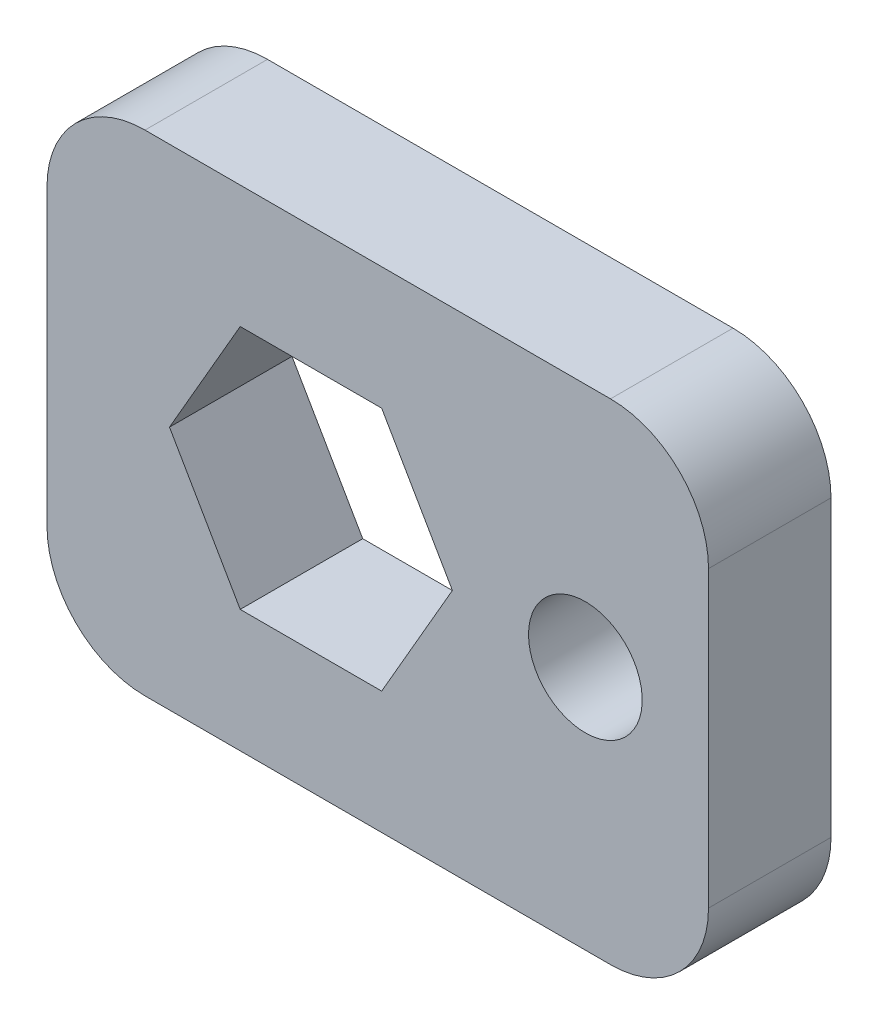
from build123d import *

# Parameters (mm, degrees)
SKETCH1_W             = 17.145
SKETCH1_H             = 12.7
BOSS_EXTRUDE1_DEPTH   = 3.175
F_4_CLEARANCE_HOLE1_D = 2.9464
FILLET1_R             = 2.54


with BuildPart() as part:
    # Sketch1 → Boss-Extrude1 (new body)
    with BuildSketch(Plane(origin=(0, 0, 0), x_dir=(-1, 0, 0), z_dir=(0, 0, -1))):
        with Locations((8.5725, 6.35)):
            Rectangle(SKETCH1_W, SKETCH1_H)
        Polygon((13.97, 6.35), (12.136912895, 9.525), (8.470738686, 9.525), (6.637651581, 6.35), (8.470738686, 3.175), (12.136912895, 3.175), align=None, mode=Mode.SUBTRACT)
    extrude(amount=BOSS_EXTRUDE1_DEPTH)

    # 4 Clearance Hole1 (through all)
    with Locations(Plane(origin=(0, 0, -3.175), x_dir=(-1, 0, 0), z_dir=(0, 0, -1))):
        with Locations((3.191825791, 6.35)):
            Hole(F_4_CLEARANCE_HOLE1_D / 2)

    # Fillet1
    fillet1_edges = [part.edges().sort_by_distance(p)[0] for p in [
        (0, 12.7, -1.5875),
        (-17.145, 12.7, -1.5875),
        (-17.145, 0, -1.5875),
        (0, 0, -1.5875),
    ]]
    fillet(fillet1_edges, radius=FILLET1_R)


solid = part.part
